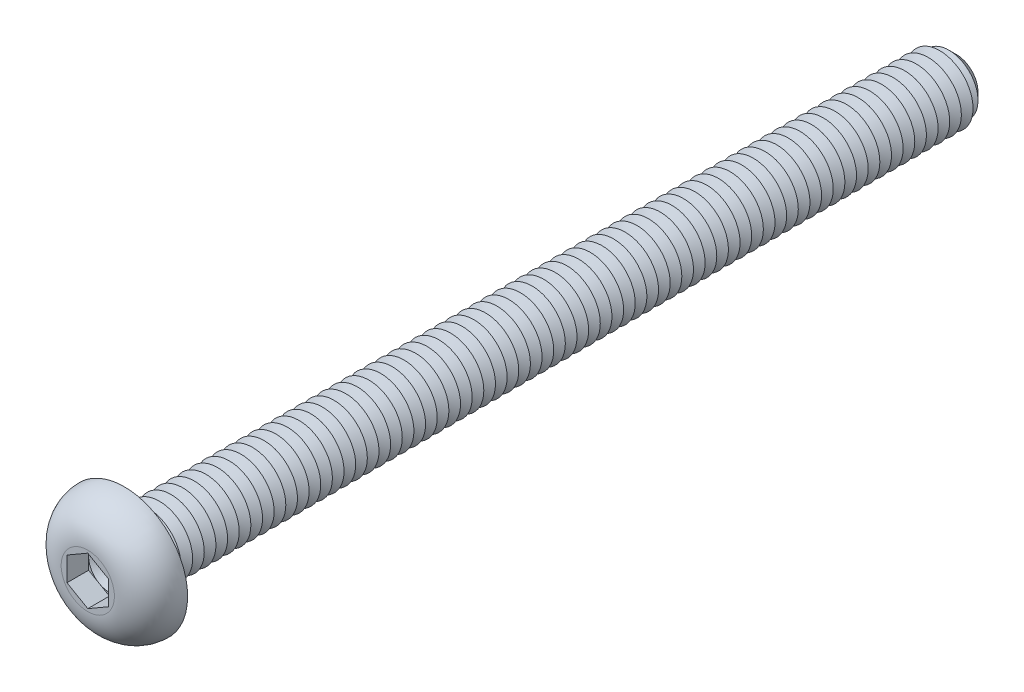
from build123d import *

# Parameters (mm, degrees)
CUT_EXTRUDE1_DEPTH  = 1.3
SKETCH4_R           = 2
BOSS_EXTRUDE1_DEPTH = 50
CHAMFER1_SIZE       = 0.7
LPATTERN1_COUNT     = 70
LPATTERN1_PITCH     = 0.7
FILLET2_R           = 0.3


with BuildPart() as part:
    # Sketch2 → Revolve1 (revolve)
    with BuildSketch(Plane(origin=(0, 0, 0), x_dir=(0, 0, -1), z_dir=(1, 0, 0)), mode=Mode.PRIVATE) as revolve1_sk:
        with BuildLine():
            Line((0, 0), (-2.2, 0))
            Line((-2.2, 0), (-2.2, 1.6))
            ThreePointArc((-2.2, 1.6), (-1.555634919, 3.155634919), (0, 3.8))
            Line((0, 3.8), (0, 0))
        make_face()
    revolve(revolve1_sk.sketch.rotate(Axis((0, 0, 47.934239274), (0, 0, -1)), 90), axis=Axis((0, 0, 47.934239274), (0, 0, -1)))

    # Sketch3 → Cut-Extrude1 (cut)
    with BuildSketch(Plane.XY.offset(2.2)):
        Polygon((0, 1.443375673), (-1.25, 0.721687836), (-1.25, -0.721687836), (0, -1.443375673), (1.25, -0.721687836), (1.25, 0.721687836), align=None)
    extrude(amount=-CUT_EXTRUDE1_DEPTH, mode=Mode.SUBTRACT)

    # Sketch4 → Boss-Extrude1 (add)
    with BuildSketch(Plane(origin=(0, 0, 0), x_dir=(-1, 0, 0), z_dir=(0, 0, -1))):
        with Locations(Location((0, 0, 0), (0, 0, 180))):
            Circle(SKETCH4_R)
    extrude(amount=BOSS_EXTRUDE1_DEPTH)

    # Chamfer1
    chamfer1_edges = [part.edges().sort_by_distance(p)[0] for p in [
        (-2, 0, -50),
    ]]
    chamfer(chamfer1_edges, length=CHAMFER1_SIZE)

    # Sketch5 → Cut-Revolve1 (revolve, cut)
    with BuildSketch(Plane(origin=(0, 0, 0), x_dir=(0, 0, -1), z_dir=(1, 0, 0)), mode=Mode.PRIVATE) as cut_revolve1_sk:
        Polygon((0.7, 2), (1.4, 2), (1.05, 1.393782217), align=None)
    cut_revolve1 = revolve(cut_revolve1_sk.sketch.rotate(Axis((0, 0, 47.934239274), (0, 0, -1)), 90), axis=Axis((0, 0, 47.934239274), (0, 0, -1)), mode=Mode.SUBTRACT)

    # LPattern1: Cut-Revolve1 ×70
    with Locations(*[(0, 0, -i * LPATTERN1_PITCH) for i in range(1, LPATTERN1_COUNT)]):
        add(cut_revolve1, mode=Mode.SUBTRACT)

    # Fillet2
    fillet2_edges = [part.edges().sort_by_distance(p)[0] for p in [
        (-2, 0, 0),
    ]]
    fillet(fillet2_edges, radius=FILLET2_R)

    # Cut-Extrude2 cone 1 section (on through the dimple's axis) → Cut-Extrude2 (revolve, cut)
    with BuildSketch(Plane(origin=(0, 0, 0.9), x_dir=(0, -1, 0), z_dir=(1, 0, 0))):
        Polygon((0, 0), (1.25, 0), (0, 0.721687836), align=None)
    revolve(axis=Axis((0, 0, 0.9), (0, 0, -1)), mode=Mode.SUBTRACT)


solid = part.part
